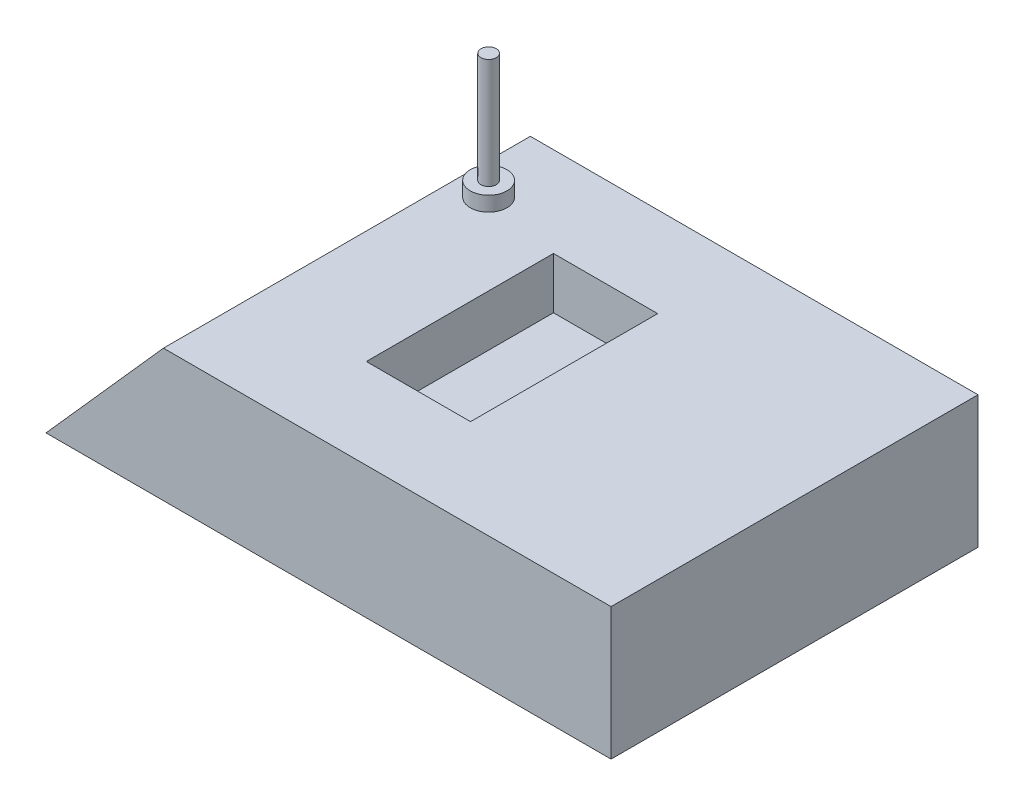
from build123d import *

# Parameters (mm, degrees)
SKETCH1_W           = 770
SKETCH1_H           = 500
BOSS_EXTRUDE1_DEPTH = 180
CUT_EXTRUDE1_DEPTH  = 657.22023742
SKETCH4_R           = 75
CUT_EXTRUDE2_DEPTH  = 110
CUT_EXTRUDE3_START  = -50
SKETCH4_2_R         = 75
CUT_EXTRUDE3_DEPTH  = 50
SKETCH5_R           = 25
BOSS_EXTRUDE2_DEPTH = 20
SKETCH6_R           = 10.5
BOSS_EXTRUDE3_DEPTH = 150
SKETCH7_W           = 142
SKETCH7_H           = 255
CUT_EXTRUDE4_DEPTH  = 70


with BuildPart() as part:
    # Sketch1 → Boss-Extrude1 (new body)
    with BuildSketch(Plane(origin=(0, 0, 0), x_dir=(1, 0, 0), z_dir=(0, 1, 0))):
        Rectangle(SKETCH1_W, SKETCH1_H)
    extrude(amount=BOSS_EXTRUDE1_DEPTH)

    # Sketch3 → Cut-Extrude1 (cut, through all)
    with BuildSketch(Plane.XY.offset(250)):
        Polygon((-385, 0), (-385, 180), (-225, 180), align=None)
    extrude(amount=-CUT_EXTRUDE1_DEPTH, mode=Mode.SUBTRACT)

    # Sketch4 → Cut-Extrude2 (cut)
    with BuildSketch(Plane(origin=(0, 70, 0), x_dir=(1, 0, 0), z_dir=(0, 1, 0))):
        with Locations((-305, -126.057791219)):
            Circle(SKETCH4_R)
    extrude(amount=CUT_EXTRUDE2_DEPTH, mode=Mode.SUBTRACT)

    # Sketch4_2 → Cut-Extrude3 (cut)
    with BuildSketch(Plane(origin=(0, 70, 0), x_dir=(1, 0, 0), z_dir=(0, 1, 0)).offset(CUT_EXTRUDE3_START)):
        with Locations((-305, -126.057791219)):
            Circle(SKETCH4_2_R)
    extrude(amount=CUT_EXTRUDE3_DEPTH, mode=Mode.SUBTRACT)

    # Sketch5 → Boss-Extrude2 (add)
    with BuildSketch(Plane(origin=(0, 180, 0), x_dir=(1, 0, 0), z_dir=(0, 1, 0))):
        with Locations(Location((-181.542171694, 149.698427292, 0), (0, 0, 90))):
            Circle(SKETCH5_R)
    extrude(amount=BOSS_EXTRUDE2_DEPTH)

    # Sketch6 → Boss-Extrude3 (add)
    with BuildSketch(Plane(origin=(0, 200, 0), x_dir=(1, 0, 0), z_dir=(0, 1, 0))):
        with Locations(Location((-181.542171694, 149.698427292, 0), (0, 0, 270))):
            Circle(SKETCH6_R)
    extrude(amount=BOSS_EXTRUDE3_DEPTH)

    # Sketch7 → Cut-Extrude4 (cut)
    with BuildSketch(Plane(origin=(0, 180, 0), x_dir=(1, 0, 0), z_dir=(0, 1, 0))):
        Rectangle(SKETCH7_W, SKETCH7_H)
    extrude(amount=-CUT_EXTRUDE4_DEPTH, mode=Mode.SUBTRACT)


solid = part.part
